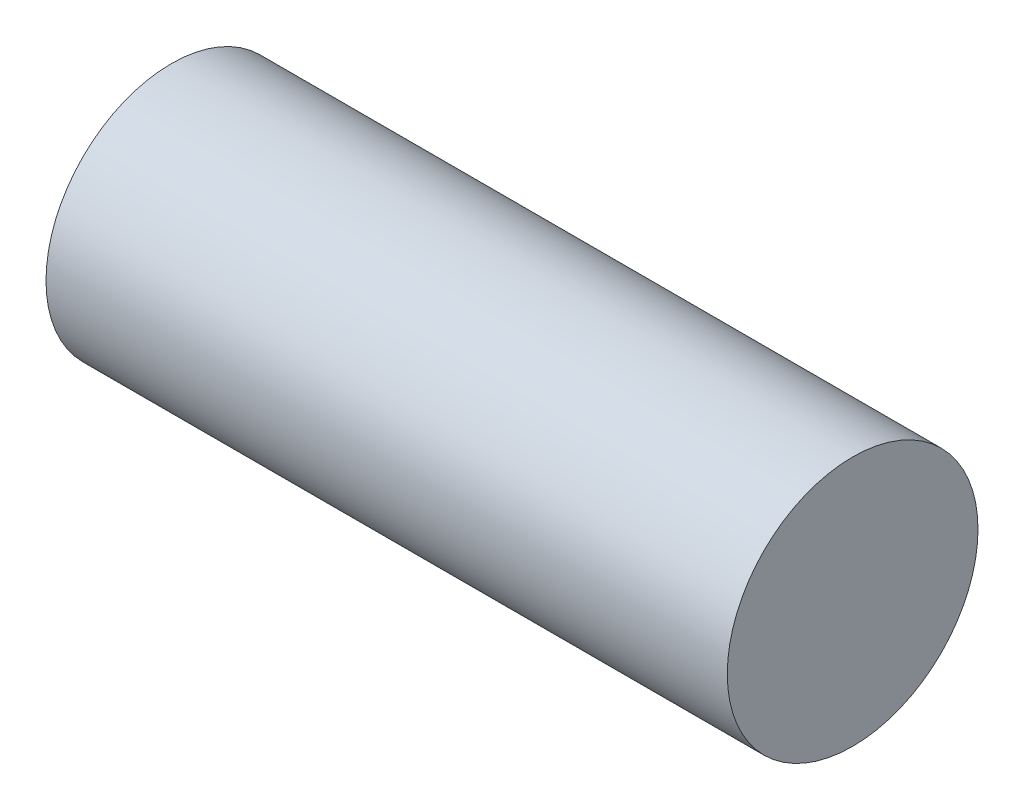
ISO-10303-21;
HEADER;
FILE_DESCRIPTION(('STEP AP214'),'2;1');
FILE_NAME('part.step','',(''),(''),'','','');
FILE_SCHEMA(('AUTOMOTIVE_DESIGN { 1 0 10303 214 1 1 1 1 }'));
ENDSEC;
DATA;
#1=APPLICATION_CONTEXT('core data for automotive mechanical design processes');
#2=APPLICATION_PROTOCOL_DEFINITION('international standard','automotive_design',2000,#1);
#3=PRODUCT_CONTEXT('',#1,'mechanical');
#4=PRODUCT('Part','Part','',(#3));
#5=PRODUCT_RELATED_PRODUCT_CATEGORY('part','',(#4));
#6=PRODUCT_DEFINITION_FORMATION('','',#4);
#7=PRODUCT_DEFINITION_CONTEXT('part definition',#1,'design');
#8=PRODUCT_DEFINITION('design','',#6,#7);
#9=PRODUCT_DEFINITION_SHAPE('','',#8);
#10=(LENGTH_UNIT() NAMED_UNIT(*) SI_UNIT(.MILLI.,.METRE.));
#11=(NAMED_UNIT(*) PLANE_ANGLE_UNIT() SI_UNIT($,.RADIAN.));
#12=(NAMED_UNIT(*) SI_UNIT($,.STERADIAN.) SOLID_ANGLE_UNIT());
#13=UNCERTAINTY_MEASURE_WITH_UNIT(LENGTH_MEASURE(1.E-05),#10,'distance_accuracy_value','');
#14=(GEOMETRIC_REPRESENTATION_CONTEXT(3) GLOBAL_UNCERTAINTY_ASSIGNED_CONTEXT((#13)) GLOBAL_UNIT_ASSIGNED_CONTEXT((#10,
#11,#12)) REPRESENTATION_CONTEXT('',''));
#15=CARTESIAN_POINT('',(0.,0.,0.));
#16=DIRECTION('',(0.,0.,1.));
#17=DIRECTION('',(1.,0.,0.));
#18=AXIS2_PLACEMENT_3D('',#15,#16,#17);
#19=CARTESIAN_POINT('',(31.75,0.,0.));
#20=DIRECTION('',(-1.,0.,0.));
#21=DIRECTION('',(0.,0.,1.));
#22=AXIS2_PLACEMENT_3D('',#19,#20,#21);
#23=CYLINDRICAL_SURFACE('',#22,5.842);
#24=CARTESIAN_POINT('',(31.75,0.,0.));
#25=DIRECTION('',(1.,0.,0.));
#26=DIRECTION('',(0.,0.,-1.));
#27=AXIS2_PLACEMENT_3D('',#24,#25,#26);
#28=CIRCLE('',#27,5.842);
#29=CARTESIAN_POINT('',(31.75,0.,-5.842));
#30=VERTEX_POINT('',#29);
#31=EDGE_CURVE('E10',#30,#30,#28,.T.);
#32=ORIENTED_EDGE('',*,*,#31,.F.);
#33=EDGE_LOOP('',(#32));
#34=FACE_BOUND('',#33,.T.);
#35=CARTESIAN_POINT('',(0.,0.,0.));
#36=DIRECTION('',(1.,0.,0.));
#37=DIRECTION('',(0.,0.,-1.));
#38=AXIS2_PLACEMENT_3D('',#35,#36,#37);
#39=CIRCLE('',#38,5.842);
#40=CARTESIAN_POINT('',(0.,0.,-5.842));
#41=VERTEX_POINT('',#40);
#42=EDGE_CURVE('E33',#41,#41,#39,.T.);
#43=ORIENTED_EDGE('',*,*,#42,.T.);
#44=EDGE_LOOP('',(#43));
#45=FACE_BOUND('',#44,.T.);
#46=ADVANCED_FACE('F30',(#34,#45),#23,.T.);
#47=CARTESIAN_POINT('',(31.75,0.,0.));
#48=DIRECTION('',(1.,0.,0.));
#49=DIRECTION('',(0.,0.,-1.));
#50=AXIS2_PLACEMENT_3D('',#47,#48,#49);
#51=PLANE('',#50);
#52=ORIENTED_EDGE('',*,*,#31,.T.);
#53=EDGE_LOOP('',(#52));
#54=FACE_BOUND('',#53,.T.);
#55=ADVANCED_FACE('F45',(#54),#51,.T.);
#56=CARTESIAN_POINT('',(0.,0.,0.));
#57=DIRECTION('',(1.,0.,0.));
#58=DIRECTION('',(0.,0.,-1.));
#59=AXIS2_PLACEMENT_3D('',#56,#57,#58);
#60=PLANE('',#59);
#61=ORIENTED_EDGE('',*,*,#42,.F.);
#62=EDGE_LOOP('',(#61));
#63=FACE_BOUND('',#62,.T.);
#64=ADVANCED_FACE('F43',(#63),#60,.F.);
#65=CLOSED_SHELL('',(#46,#55,#64));
#66=MANIFOLD_SOLID_BREP('B2',#65);
#67=ADVANCED_BREP_SHAPE_REPRESENTATION('',(#18,#66),#14);
#68=SHAPE_DEFINITION_REPRESENTATION(#9,#67);
ENDSEC;
END-ISO-10303-21;
